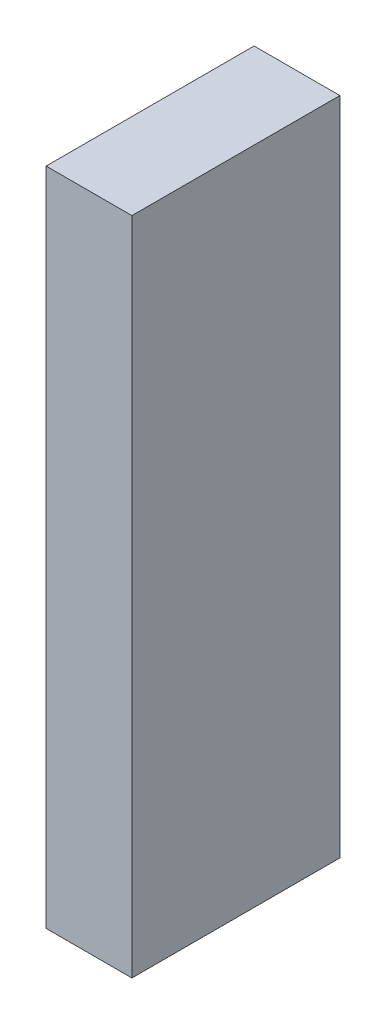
ISO-10303-21;
HEADER;
FILE_DESCRIPTION(('STEP AP214'),'2;1');
FILE_NAME('part.step','',(''),(''),'','','');
FILE_SCHEMA(('AUTOMOTIVE_DESIGN { 1 0 10303 214 1 1 1 1 }'));
ENDSEC;
DATA;
#1=APPLICATION_CONTEXT('core data for automotive mechanical design processes');
#2=APPLICATION_PROTOCOL_DEFINITION('international standard','automotive_design',2000,#1);
#3=PRODUCT_CONTEXT('',#1,'mechanical');
#4=PRODUCT('Part','Part','',(#3));
#5=PRODUCT_RELATED_PRODUCT_CATEGORY('part','',(#4));
#6=PRODUCT_DEFINITION_FORMATION('','',#4);
#7=PRODUCT_DEFINITION_CONTEXT('part definition',#1,'design');
#8=PRODUCT_DEFINITION('design','',#6,#7);
#9=PRODUCT_DEFINITION_SHAPE('','',#8);
#10=(LENGTH_UNIT() NAMED_UNIT(*) SI_UNIT(.MILLI.,.METRE.));
#11=(NAMED_UNIT(*) PLANE_ANGLE_UNIT() SI_UNIT($,.RADIAN.));
#12=(NAMED_UNIT(*) SI_UNIT($,.STERADIAN.) SOLID_ANGLE_UNIT());
#13=UNCERTAINTY_MEASURE_WITH_UNIT(LENGTH_MEASURE(1.E-05),#10,'distance_accuracy_value','');
#14=(GEOMETRIC_REPRESENTATION_CONTEXT(3) GLOBAL_UNCERTAINTY_ASSIGNED_CONTEXT((#13)) GLOBAL_UNIT_ASSIGNED_CONTEXT((#10,
#11,#12)) REPRESENTATION_CONTEXT('',''));
#15=CARTESIAN_POINT('',(0.,0.,0.));
#16=DIRECTION('',(0.,0.,1.));
#17=DIRECTION('',(1.,0.,0.));
#18=AXIS2_PLACEMENT_3D('',#15,#16,#17);
#19=CARTESIAN_POINT('',(0.,0.,0.3999992));
#20=DIRECTION('',(0.,0.,-1.));
#21=DIRECTION('',(0.,-1.,0.));
#22=AXIS2_PLACEMENT_3D('',#19,#20,#21);
#23=PLANE('',#22);
#24=DIRECTION('',(0.,-1.,0.));
#25=VECTOR('',#24,1.);
#26=CARTESIAN_POINT('',(0.08250174,0.635,0.3999992));
#27=LINE('',#26,#25);
#28=CARTESIAN_POINT('',(0.08250174,0.635,0.3999992));
#29=VERTEX_POINT('',#28);
#30=CARTESIAN_POINT('',(0.08250174,-0.635,0.3999992));
#31=VERTEX_POINT('',#30);
#32=EDGE_CURVE('E26',#29,#31,#27,.T.);
#33=ORIENTED_EDGE('',*,*,#32,.F.);
#34=DIRECTION('',(1.,0.,0.));
#35=VECTOR('',#34,1.);
#36=CARTESIAN_POINT('',(-0.08250174,0.635,0.3999992));
#37=LINE('',#36,#35);
#38=CARTESIAN_POINT('',(-0.08250174,0.635,0.3999992));
#39=VERTEX_POINT('',#38);
#40=EDGE_CURVE('E75',#39,#29,#37,.T.);
#41=ORIENTED_EDGE('',*,*,#40,.F.);
#42=DIRECTION('',(0.,1.,0.));
#43=VECTOR('',#42,1.);
#44=CARTESIAN_POINT('',(-0.08250174,-0.635,0.3999992));
#45=LINE('',#44,#43);
#46=CARTESIAN_POINT('',(-0.08250174,-0.635,0.3999992));
#47=VERTEX_POINT('',#46);
#48=EDGE_CURVE('E69',#47,#39,#45,.T.);
#49=ORIENTED_EDGE('',*,*,#48,.F.);
#50=DIRECTION('',(-1.,0.,0.));
#51=VECTOR('',#50,1.);
#52=CARTESIAN_POINT('',(0.08250174,-0.635,0.3999992));
#53=LINE('',#52,#51);
#54=EDGE_CURVE('E72',#31,#47,#53,.T.);
#55=ORIENTED_EDGE('',*,*,#54,.F.);
#56=EDGE_LOOP('',(#33,#41,#49,#55));
#57=FACE_BOUND('',#56,.T.);
#58=ADVANCED_FACE('F17',(#57),#23,.F.);
#59=CARTESIAN_POINT('',(0.,0.,0.));
#60=DIRECTION('',(0.,0.,-1.));
#61=DIRECTION('',(0.,-1.,0.));
#62=AXIS2_PLACEMENT_3D('',#59,#60,#61);
#63=PLANE('',#62);
#64=DIRECTION('',(-1.,0.,0.));
#65=VECTOR('',#64,1.);
#66=CARTESIAN_POINT('',(0.08250174,-0.635,0.));
#67=LINE('',#66,#65);
#68=CARTESIAN_POINT('',(0.08250174,-0.635,0.));
#69=VERTEX_POINT('',#68);
#70=CARTESIAN_POINT('',(-0.08250174,-0.635,0.));
#71=VERTEX_POINT('',#70);
#72=EDGE_CURVE('E81',#69,#71,#67,.T.);
#73=ORIENTED_EDGE('',*,*,#72,.T.);
#74=DIRECTION('',(0.,1.,0.));
#75=VECTOR('',#74,1.);
#76=CARTESIAN_POINT('',(-0.08250174,-0.635,0.));
#77=LINE('',#76,#75);
#78=CARTESIAN_POINT('',(-0.08250174,0.635,0.));
#79=VERTEX_POINT('',#78);
#80=EDGE_CURVE('E87',#71,#79,#77,.T.);
#81=ORIENTED_EDGE('',*,*,#80,.T.);
#82=DIRECTION('',(1.,0.,0.));
#83=VECTOR('',#82,1.);
#84=CARTESIAN_POINT('',(-0.08250174,0.635,0.));
#85=LINE('',#84,#83);
#86=CARTESIAN_POINT('',(0.08250174,0.635,0.));
#87=VERTEX_POINT('',#86);
#88=EDGE_CURVE('E20',#79,#87,#85,.T.);
#89=ORIENTED_EDGE('',*,*,#88,.T.);
#90=DIRECTION('',(0.,-1.,0.));
#91=VECTOR('',#90,1.);
#92=CARTESIAN_POINT('',(0.08250174,0.635,0.));
#93=LINE('',#92,#91);
#94=EDGE_CURVE('E11',#87,#69,#93,.T.);
#95=ORIENTED_EDGE('',*,*,#94,.T.);
#96=EDGE_LOOP('',(#73,#81,#89,#95));
#97=FACE_BOUND('',#96,.T.);
#98=ADVANCED_FACE('F120',(#97),#63,.T.);
#99=CARTESIAN_POINT('',(0.08250174,0.635,0.));
#100=DIRECTION('',(1.,0.,0.));
#101=DIRECTION('',(0.,1.,0.));
#102=AXIS2_PLACEMENT_3D('',#99,#100,#101);
#103=PLANE('',#102);
#104=DIRECTION('',(0.,0.,1.));
#105=VECTOR('',#104,1.);
#106=CARTESIAN_POINT('',(0.08250174,0.635,0.));
#107=LINE('',#106,#105);
#108=EDGE_CURVE('E111',#87,#29,#107,.T.);
#109=ORIENTED_EDGE('',*,*,#108,.T.);
#110=ORIENTED_EDGE('',*,*,#32,.T.);
#111=DIRECTION('',(0.,0.,1.));
#112=VECTOR('',#111,1.);
#113=CARTESIAN_POINT('',(0.08250174,-0.635,0.));
#114=LINE('',#113,#112);
#115=EDGE_CURVE('E94',#69,#31,#114,.T.);
#116=ORIENTED_EDGE('',*,*,#115,.F.);
#117=ORIENTED_EDGE('',*,*,#94,.F.);
#118=EDGE_LOOP('',(#109,#110,#116,#117));
#119=FACE_BOUND('',#118,.T.);
#120=ADVANCED_FACE('F124',(#119),#103,.T.);
#121=CARTESIAN_POINT('',(-0.08250174,0.635,0.));
#122=DIRECTION('',(0.,1.,0.));
#123=DIRECTION('',(1.,0.,0.));
#124=AXIS2_PLACEMENT_3D('',#121,#122,#123);
#125=PLANE('',#124);
#126=DIRECTION('',(0.,0.,1.));
#127=VECTOR('',#126,1.);
#128=CARTESIAN_POINT('',(-0.08250174,0.635,0.));
#129=LINE('',#128,#127);
#130=EDGE_CURVE('E80',#79,#39,#129,.T.);
#131=ORIENTED_EDGE('',*,*,#130,.T.);
#132=ORIENTED_EDGE('',*,*,#40,.T.);
#133=ORIENTED_EDGE('',*,*,#108,.F.);
#134=ORIENTED_EDGE('',*,*,#88,.F.);
#135=EDGE_LOOP('',(#131,#132,#133,#134));
#136=FACE_BOUND('',#135,.T.);
#137=ADVANCED_FACE('F122',(#136),#125,.T.);
#138=CARTESIAN_POINT('',(-0.08250174,-0.635,0.));
#139=DIRECTION('',(-1.,0.,0.));
#140=DIRECTION('',(0.,0.,1.));
#141=AXIS2_PLACEMENT_3D('',#138,#139,#140);
#142=PLANE('',#141);
#143=DIRECTION('',(0.,0.,1.));
#144=VECTOR('',#143,1.);
#145=CARTESIAN_POINT('',(-0.08250174,-0.635,0.));
#146=LINE('',#145,#144);
#147=EDGE_CURVE('E84',#71,#47,#146,.T.);
#148=ORIENTED_EDGE('',*,*,#147,.T.);
#149=ORIENTED_EDGE('',*,*,#48,.T.);
#150=ORIENTED_EDGE('',*,*,#130,.F.);
#151=ORIENTED_EDGE('',*,*,#80,.F.);
#152=EDGE_LOOP('',(#148,#149,#150,#151));
#153=FACE_BOUND('',#152,.T.);
#154=ADVANCED_FACE('F85',(#153),#142,.T.);
#155=CARTESIAN_POINT('',(0.08250174,-0.635,0.));
#156=DIRECTION('',(0.,-1.,0.));
#157=DIRECTION('',(0.,0.,-1.));
#158=AXIS2_PLACEMENT_3D('',#155,#156,#157);
#159=PLANE('',#158);
#160=ORIENTED_EDGE('',*,*,#115,.T.);
#161=ORIENTED_EDGE('',*,*,#54,.T.);
#162=ORIENTED_EDGE('',*,*,#147,.F.);
#163=ORIENTED_EDGE('',*,*,#72,.F.);
#164=EDGE_LOOP('',(#160,#161,#162,#163));
#165=FACE_BOUND('',#164,.T.);
#166=ADVANCED_FACE('F93',(#165),#159,.T.);
#167=CLOSED_SHELL('',(#58,#98,#120,#137,#154,#166));
#168=MANIFOLD_SOLID_BREP('B1',#167);
#169=ADVANCED_BREP_SHAPE_REPRESENTATION('',(#18,#168),#14);
#170=SHAPE_DEFINITION_REPRESENTATION(#9,#169);
ENDSEC;
END-ISO-10303-21;
